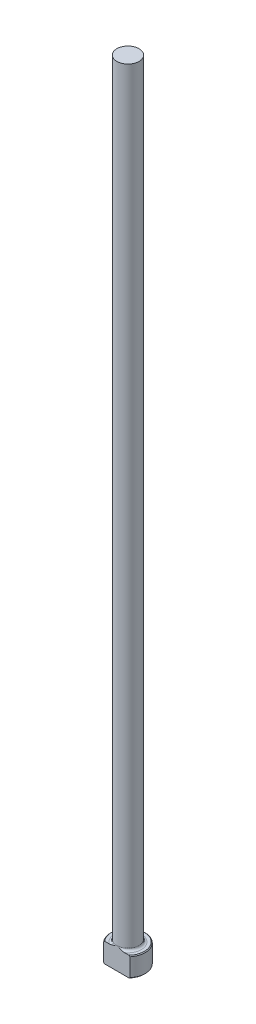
from build123d import *

# Parameters (mm, degrees)
CHAMFER1_SIZE = 0.254
FILLET1_R     = 0.762
KEY_DEPTH     = 255.121236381


with BuildPart() as part:
    # Sketch1 → Revolve1 (revolve)
    with BuildSketch(Plane.XY, mode=Mode.PRIVATE) as revolve1_sk:
        Polygon((0, 0), (-5.5499, 0), (-5.5499, 6.35), (-3.57124, 6.35), (-3.57124, 254), (0, 254), align=None)
    revolve(revolve1_sk.sketch.rotate(Axis((0, 259.958771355, 0), (0, -1, 0)), 270), axis=Axis((0, 259.958771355, 0), (0, -1, 0)))

    # Chamfer1
    chamfer1_edges = [part.edges().sort_by_distance(p)[0] for p in [
        (0, 6.35, -5.5499),
        (0, 0, -5.5499),
    ]]
    chamfer(chamfer1_edges, length=CHAMFER1_SIZE)

    # Fillet1
    fillet1_edges = [part.edges().sort_by_distance(p)[0] for p in [
        (0, 6.35, -3.57124),
    ]]
    fillet(fillet1_edges, radius=FILLET1_R)

    # Sketch2 → Key (cut, through all)
    with BuildSketch(Plane(origin=(0, 0, 0), x_dir=(1, 0, 0), z_dir=(0, 1, 0))):
        with BuildLine():
            Line((-4.248250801, -3.57124), (4.248250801, -3.57124))
            ThreePointArc((4.248250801, -3.57124), (0, -5.5499), (-4.248250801, -3.57124))
        make_face()
    extrude(amount=KEY_DEPTH, mode=Mode.SUBTRACT)


solid = part.part
